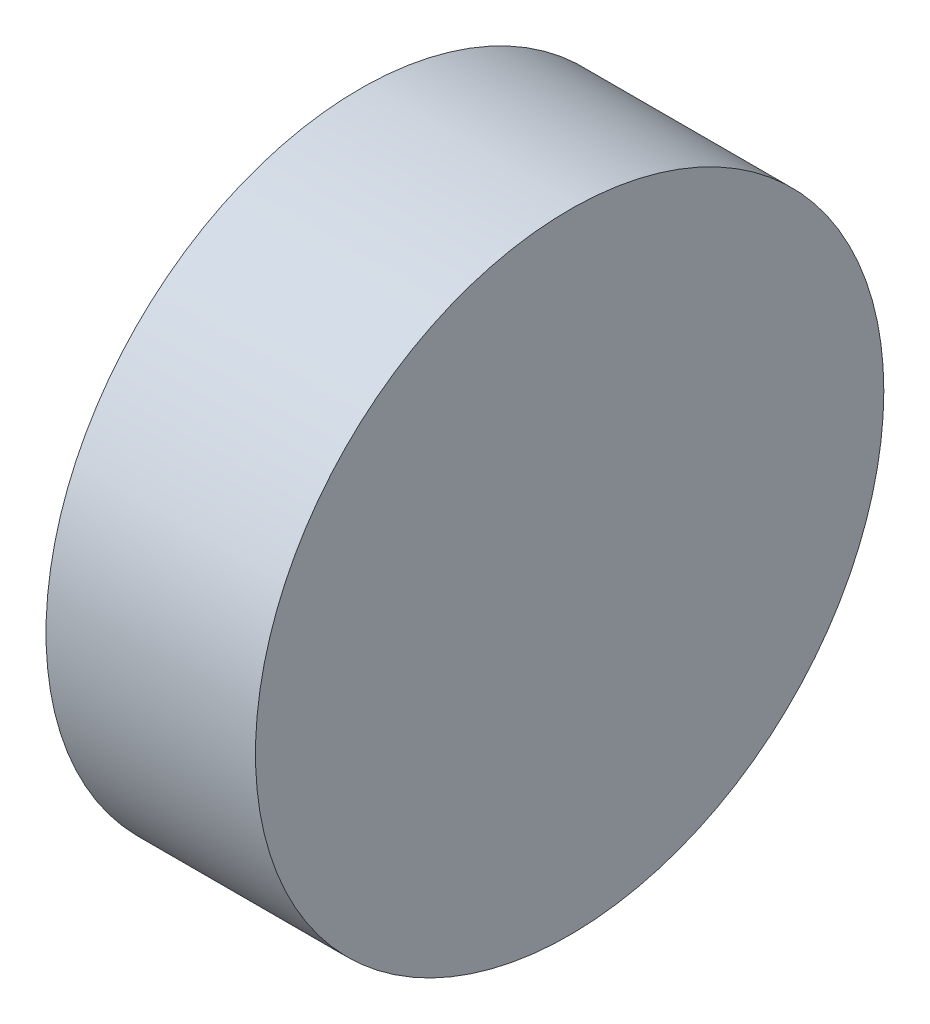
ISO-10303-21;
HEADER;
FILE_DESCRIPTION(('STEP AP214'),'2;1');
FILE_NAME('part.step','',(''),(''),'','','');
FILE_SCHEMA(('AUTOMOTIVE_DESIGN { 1 0 10303 214 1 1 1 1 }'));
ENDSEC;
DATA;
#1=APPLICATION_CONTEXT('core data for automotive mechanical design processes');
#2=APPLICATION_PROTOCOL_DEFINITION('international standard','automotive_design',2000,#1);
#3=PRODUCT_CONTEXT('',#1,'mechanical');
#4=PRODUCT('Part','Part','',(#3));
#5=PRODUCT_RELATED_PRODUCT_CATEGORY('part','',(#4));
#6=PRODUCT_DEFINITION_FORMATION('','',#4);
#7=PRODUCT_DEFINITION_CONTEXT('part definition',#1,'design');
#8=PRODUCT_DEFINITION('design','',#6,#7);
#9=PRODUCT_DEFINITION_SHAPE('','',#8);
#10=(LENGTH_UNIT() NAMED_UNIT(*) SI_UNIT(.MILLI.,.METRE.));
#11=(NAMED_UNIT(*) PLANE_ANGLE_UNIT() SI_UNIT($,.RADIAN.));
#12=(NAMED_UNIT(*) SI_UNIT($,.STERADIAN.) SOLID_ANGLE_UNIT());
#13=UNCERTAINTY_MEASURE_WITH_UNIT(LENGTH_MEASURE(1.E-05),#10,'distance_accuracy_value','');
#14=(GEOMETRIC_REPRESENTATION_CONTEXT(3) GLOBAL_UNCERTAINTY_ASSIGNED_CONTEXT((#13)) GLOBAL_UNIT_ASSIGNED_CONTEXT((#10,
#11,#12)) REPRESENTATION_CONTEXT('',''));
#15=CARTESIAN_POINT('',(0.,0.,0.));
#16=DIRECTION('',(0.,0.,1.));
#17=DIRECTION('',(1.,0.,0.));
#18=AXIS2_PLACEMENT_3D('',#15,#16,#17);
#19=CARTESIAN_POINT('',(30.,0.,0.));
#20=DIRECTION('',(-1.,0.,0.));
#21=DIRECTION('',(0.,0.,1.));
#22=AXIS2_PLACEMENT_3D('',#19,#20,#21);
#23=CYLINDRICAL_SURFACE('',#22,45.);
#24=CARTESIAN_POINT('',(30.,0.,0.));
#25=DIRECTION('',(1.,0.,0.));
#26=DIRECTION('',(0.,0.,-1.));
#27=AXIS2_PLACEMENT_3D('',#24,#25,#26);
#28=CIRCLE('',#27,45.);
#29=CARTESIAN_POINT('',(30.,0.,-45.));
#30=VERTEX_POINT('',#29);
#31=EDGE_CURVE('E10',#30,#30,#28,.T.);
#32=ORIENTED_EDGE('',*,*,#31,.F.);
#33=EDGE_LOOP('',(#32));
#34=FACE_BOUND('',#33,.T.);
#35=CARTESIAN_POINT('',(0.,0.,0.));
#36=DIRECTION('',(1.,0.,0.));
#37=DIRECTION('',(0.,0.,-1.));
#38=AXIS2_PLACEMENT_3D('',#35,#36,#37);
#39=CIRCLE('',#38,45.);
#40=CARTESIAN_POINT('',(0.,0.,-45.));
#41=VERTEX_POINT('',#40);
#42=EDGE_CURVE('E35',#41,#41,#39,.T.);
#43=ORIENTED_EDGE('',*,*,#42,.T.);
#44=EDGE_LOOP('',(#43));
#45=FACE_BOUND('',#44,.T.);
#46=ADVANCED_FACE('F32',(#34,#45),#23,.T.);
#47=CARTESIAN_POINT('',(30.,0.,0.));
#48=DIRECTION('',(1.,0.,0.));
#49=DIRECTION('',(0.,0.,-1.));
#50=AXIS2_PLACEMENT_3D('',#47,#48,#49);
#51=PLANE('',#50);
#52=ORIENTED_EDGE('',*,*,#31,.T.);
#53=EDGE_LOOP('',(#52));
#54=FACE_BOUND('',#53,.T.);
#55=ADVANCED_FACE('F47',(#54),#51,.T.);
#56=CARTESIAN_POINT('',(0.,0.,0.));
#57=DIRECTION('',(1.,0.,0.));
#58=DIRECTION('',(0.,0.,-1.));
#59=AXIS2_PLACEMENT_3D('',#56,#57,#58);
#60=PLANE('',#59);
#61=ORIENTED_EDGE('',*,*,#42,.F.);
#62=EDGE_LOOP('',(#61));
#63=FACE_BOUND('',#62,.T.);
#64=ADVANCED_FACE('F45',(#63),#60,.F.);
#65=CLOSED_SHELL('',(#46,#55,#64));
#66=MANIFOLD_SOLID_BREP('B2',#65);
#67=ADVANCED_BREP_SHAPE_REPRESENTATION('',(#18,#66),#14);
#68=SHAPE_DEFINITION_REPRESENTATION(#9,#67);
ENDSEC;
END-ISO-10303-21;
